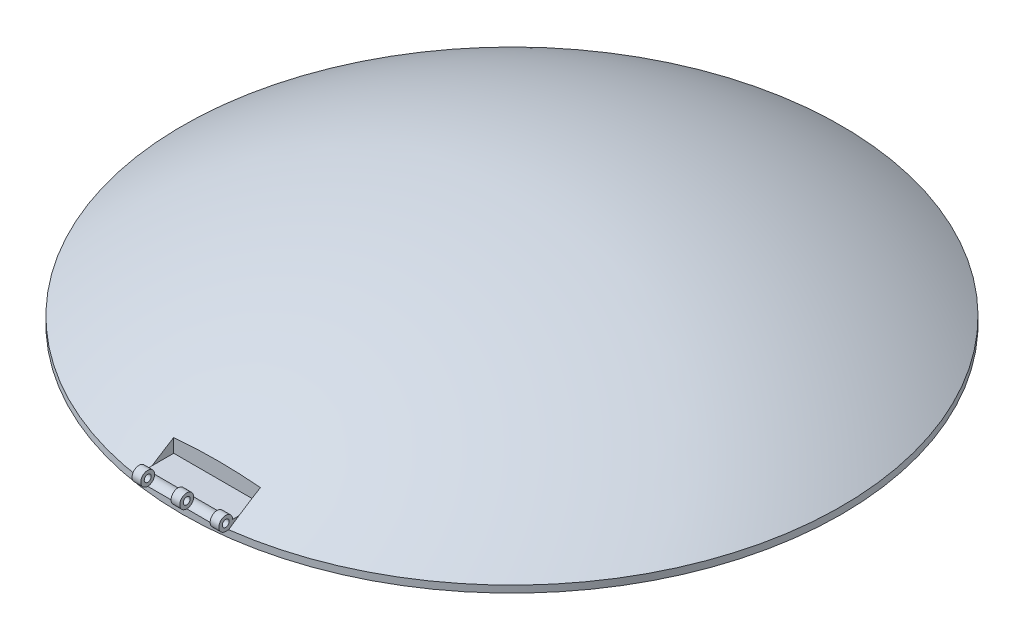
from build123d import *

# Parameters (mm, degrees)
SKETCH2_R           = 120.65
BOSS_EXTRUDE3_DEPTH = 2.54
DOME1_FACE_RADIUS   = 120.65
DOME1_HEIGHT        = 38.1
SKETCH1_R           = 101.6
CUT_EXTRUDE1_DEPTH  = 12.7
SKETCH3_W           = 31.75
SKETCH3_H           = 10.16
CUT_EXTRUDE3_DEPTH  = 12.7
SKETCH5_W           = 31.75
SKETCH5_H           = 12.7
BOSS_EXTRUDE4_DEPTH = 2.54
SKETCH6_R           = 2.54
BOSS_EXTRUDE5_DEPTH = 1.5875
SKETCH7_R           = 2.54
BOSS_EXTRUDE6_DEPTH = 3.175
BOSS_EXTRUDE7_START = -3.175
SKETCH8_R           = 2.54
BOSS_EXTRUDE7_DEPTH = 3.175
CUT_EXTRUDE4_REACH  = 190.325
SKETCH9_R           = 1.27
CUT_EXTRUDE6_START  = 11.1125
SKETCH11_R          = 2.54
CUT_EXTRUDE6_DEPTH  = 11.1125
CUT_EXTRUDE7_START  = 11.1125
SKETCH12_R          = 2.54
CUT_EXTRUDE7_DEPTH  = 11.1125


with BuildPart() as part:
    # Sketch2 → Boss-Extrude3 (new body)
    with BuildSketch(Plane(origin=(0, 0, 0), x_dir=(1, 0, 0), z_dir=(0, 1, 0))):
        with Locations(Location((0, 0, 0), (0, 0, 90))):
            Circle(SKETCH2_R)
    extrude(amount=BOSS_EXTRUDE3_DEPTH)

    # Dome1: a dome of height H over a round flat face of radius A is a cap of a sphere of radius (A * A + H * H) / (2 * H)
    dome1_r = (DOME1_FACE_RADIUS * DOME1_FACE_RADIUS + DOME1_HEIGHT * DOME1_HEIGHT) / (2 * DOME1_HEIGHT)
    dome1_base = Plane((0, 2.54, 0), z_dir=(0, 1, 0))
    with Locations(dome1_base.offset(DOME1_HEIGHT - dome1_r)):
        dome1_ball = Sphere(dome1_r, mode=Mode.PRIVATE)
    add(split(dome1_ball, bisect_by=dome1_base, keep=Keep.TOP, mode=Mode.PRIVATE))

    # Sketch1 → Cut-Extrude1 (cut)
    with BuildSketch(Plane(origin=(0, 0, 0), x_dir=(1, 0, 0), z_dir=(0, 1, 0))):
        with Locations(Location((0, 0, 0), (0, 0, 270))):
            Circle(SKETCH1_R)
    extrude(amount=CUT_EXTRUDE1_DEPTH, mode=Mode.SUBTRACT)

    # Sketch3 → Cut-Extrude3 (cut)
    with BuildSketch(Plane.XY.offset(120.65)):
        with Locations((0, 7.62)):
            Rectangle(SKETCH3_W, SKETCH3_H)
    extrude(amount=-CUT_EXTRUDE3_DEPTH, mode=Mode.SUBTRACT)

    # Sketch5 → Boss-Extrude4 (add)
    with BuildSketch(Plane(origin=(0, 2.54, 0), x_dir=(1, 0, 0), z_dir=(0, 1, 0))):
        with Locations((0, -114.3)):
            Rectangle(SKETCH5_W, SKETCH5_H)
    extrude(amount=BOSS_EXTRUDE4_DEPTH)

    # Sketch6 → Boss-Extrude5 (add, symmetric)
    with BuildSketch(Plane(origin=(0, 0, 0), x_dir=(0, 0, -1), z_dir=(1, 0, 0))):
        with Locations((-120.65, 5.08)):
            Circle(SKETCH6_R)
    extrude(amount=BOSS_EXTRUDE5_DEPTH, both=True)

    # Sketch7 → Boss-Extrude6 (add)
    with BuildSketch(Plane(origin=(15.875, 0, 0), x_dir=(0, 0, -1), z_dir=(1, 0, 0))):
        with Locations((-120.65, 5.08)):
            Circle(SKETCH7_R)
    extrude(amount=-BOSS_EXTRUDE6_DEPTH)

    # Sketch8 → Boss-Extrude7 (add)
    with BuildSketch(Plane.ZY.offset(15.875).offset(BOSS_EXTRUDE7_START)):
        with Locations((120.65, 5.08)):
            Circle(SKETCH8_R)
    extrude(amount=BOSS_EXTRUDE7_DEPTH)

    # Cut-Extrude4: up to this face of the body (flat: up to its plane)
    cut_extrude4_end = Plane(part.part.faces().sort_by_distance((15.875, 4.996105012, 120.352260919))[0])
    # Sketch9 → Cut-Extrude4 (cut, up to the picked face)
    with BuildSketch(Plane.ZY.offset(15.875), mode=Mode.PRIVATE) as cut_extrude4_sk1:
        with Locations(Location((120.65, 5.08, 0), (0, 0, 270))):
            Circle(SKETCH9_R)
    cut_extrude4_tool1 = split(extrude(cut_extrude4_sk1.sketch, amount=-CUT_EXTRUDE4_REACH, mode=Mode.PRIVATE), bisect_by=cut_extrude4_end, keep=Keep.BOTH, mode=Mode.PRIVATE)
    add(cut_extrude4_tool1.solids().sort_by(Axis((-15.875, 5.08, 120.65), (1, 0, 0)))[0], mode=Mode.SUBTRACT)

    # Sketch11 → Cut-Extrude6 (cut)
    with BuildSketch(Plane(origin=(1.5875, 0, 0), x_dir=(0, 0, -1), z_dir=(1, 0, 0)).offset(CUT_EXTRUDE6_START)):
        with Locations((-120.65, 5.08)):
            Circle(SKETCH11_R)
    extrude(amount=-CUT_EXTRUDE6_DEPTH, mode=Mode.SUBTRACT)

    # Sketch12 → Cut-Extrude7 (cut)
    with BuildSketch(Plane(origin=(-12.7, 0, 0), x_dir=(0, 0, -1), z_dir=(1, 0, 0)).offset(CUT_EXTRUDE7_START)):
        with Locations((-120.65, 5.08)):
            Circle(SKETCH12_R)
    extrude(amount=-CUT_EXTRUDE7_DEPTH, mode=Mode.SUBTRACT)


solid = part.part
